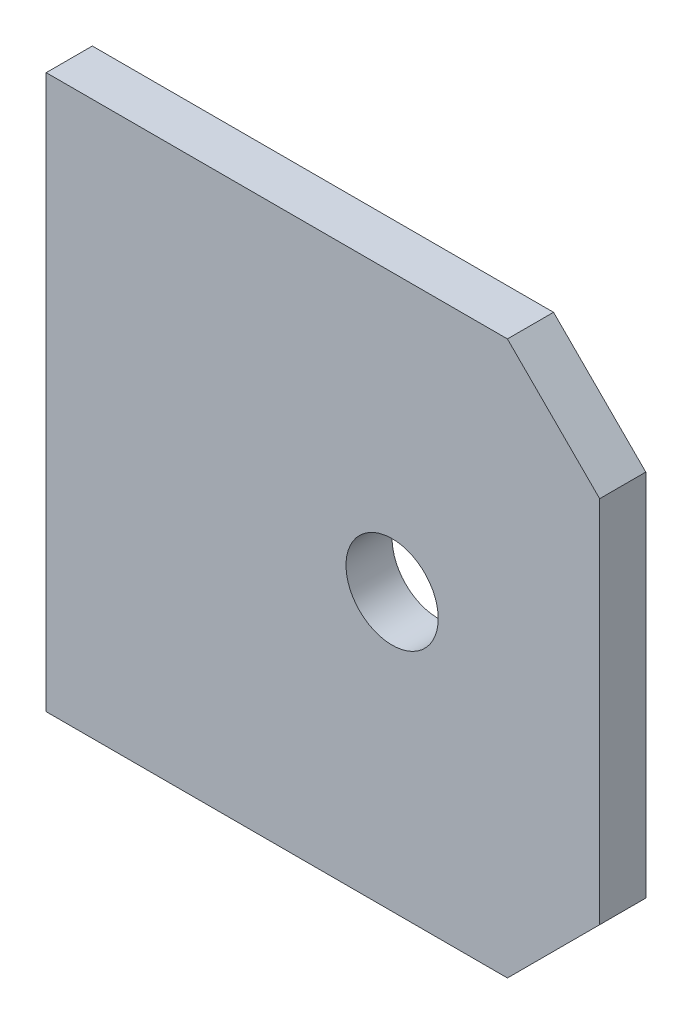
from build123d import *

# Parameters (mm, degrees)
ESQUISSE1_R          = 10
BASE_EXTRUSION_DEPTH = 10


with BuildPart() as part:
    # Esquisse1 → Base-Extrusion (new body)
    with BuildSketch(Plane.XY):
        Polygon((100, 0), (120, -20), (120, -100), (100, -120), (0, -120), (0, 0), align=None)
        with Locations((75, -60)):
            Circle(ESQUISSE1_R, mode=Mode.SUBTRACT)
    extrude(amount=BASE_EXTRUSION_DEPTH)


solid = part.part
